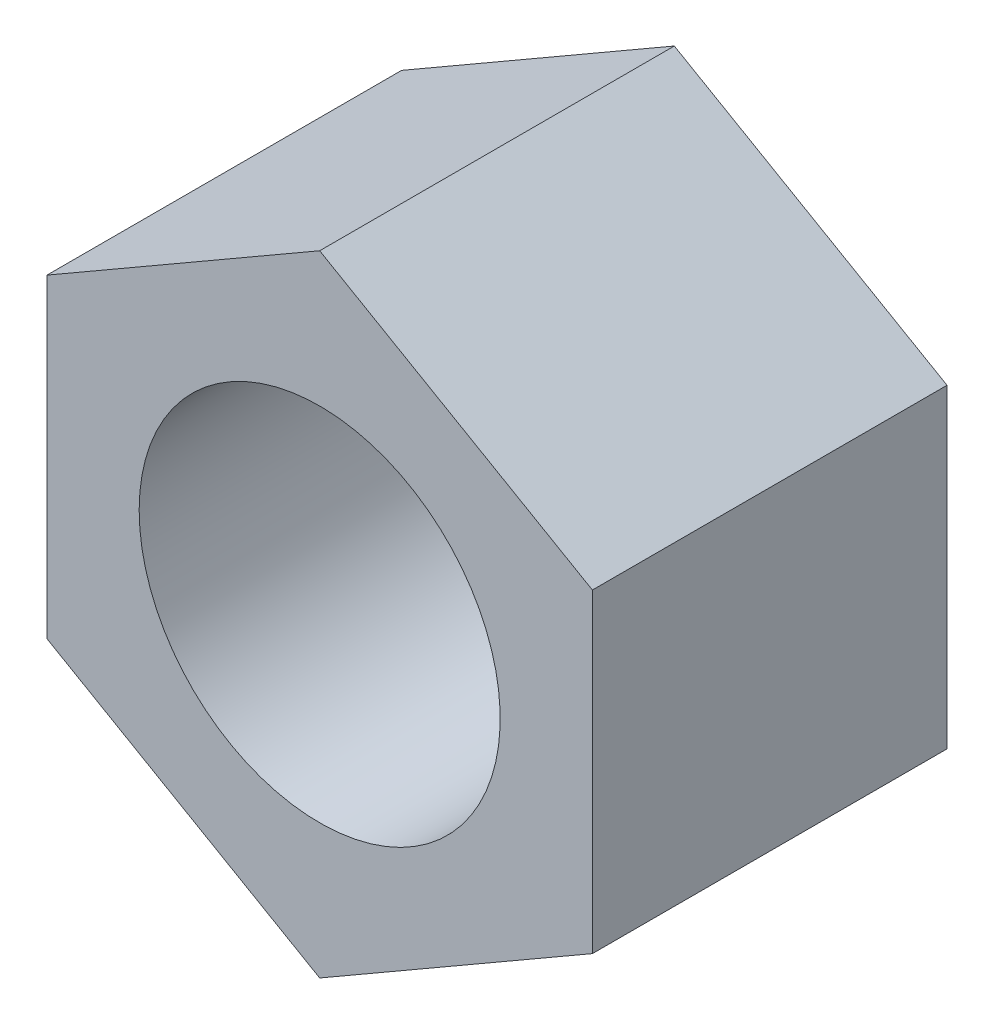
ISO-10303-21;
HEADER;
FILE_DESCRIPTION(('STEP AP214'),'2;1');
FILE_NAME('part.step','',(''),(''),'','','');
FILE_SCHEMA(('AUTOMOTIVE_DESIGN { 1 0 10303 214 1 1 1 1 }'));
ENDSEC;
DATA;
#1=APPLICATION_CONTEXT('core data for automotive mechanical design processes');
#2=APPLICATION_PROTOCOL_DEFINITION('international standard','automotive_design',2000,#1);
#3=PRODUCT_CONTEXT('',#1,'mechanical');
#4=PRODUCT('Part','Part','',(#3));
#5=PRODUCT_RELATED_PRODUCT_CATEGORY('part','',(#4));
#6=PRODUCT_DEFINITION_FORMATION('','',#4);
#7=PRODUCT_DEFINITION_CONTEXT('part definition',#1,'design');
#8=PRODUCT_DEFINITION('design','',#6,#7);
#9=PRODUCT_DEFINITION_SHAPE('','',#8);
#10=(LENGTH_UNIT() NAMED_UNIT(*) SI_UNIT(.MILLI.,.METRE.));
#11=(NAMED_UNIT(*) PLANE_ANGLE_UNIT() SI_UNIT($,.RADIAN.));
#12=(NAMED_UNIT(*) SI_UNIT($,.STERADIAN.) SOLID_ANGLE_UNIT());
#13=UNCERTAINTY_MEASURE_WITH_UNIT(LENGTH_MEASURE(1.E-05),#10,'distance_accuracy_value','');
#14=(GEOMETRIC_REPRESENTATION_CONTEXT(3) GLOBAL_UNCERTAINTY_ASSIGNED_CONTEXT((#13)) GLOBAL_UNIT_ASSIGNED_CONTEXT((#10,
#11,#12)) REPRESENTATION_CONTEXT('',''));
#15=CARTESIAN_POINT('',(0.,0.,0.));
#16=DIRECTION('',(0.,0.,1.));
#17=DIRECTION('',(1.,0.,0.));
#18=AXIS2_PLACEMENT_3D('',#15,#16,#17);
#19=CARTESIAN_POINT('',(0.,0.,87.3252));
#20=DIRECTION('',(0.,0.,1.));
#21=DIRECTION('',(1.,0.,0.));
#22=AXIS2_PLACEMENT_3D('',#19,#20,#21);
#23=PLANE('',#22);
#24=DIRECTION('',(0.,1.,0.));
#25=VECTOR('',#24,1.);
#26=CARTESIAN_POINT('',(67.15125,-38.7697922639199,87.3252));
#27=LINE('',#26,#25);
#28=CARTESIAN_POINT('',(67.15125,-38.7697922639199,87.3252));
#29=VERTEX_POINT('',#28);
#30=CARTESIAN_POINT('',(67.15125,38.7697922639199,87.3252));
#31=VERTEX_POINT('',#30);
#32=EDGE_CURVE('E155',#29,#31,#27,.T.);
#33=ORIENTED_EDGE('',*,*,#32,.T.);
#34=DIRECTION('',(-0.866025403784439,0.5,0.));
#35=VECTOR('',#34,1.);
#36=CARTESIAN_POINT('',(67.15125,38.7697922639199,87.3252));
#37=LINE('',#36,#35);
#38=CARTESIAN_POINT('',(0.,77.5395845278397,87.3252));
#39=VERTEX_POINT('',#38);
#40=EDGE_CURVE('E99',#31,#39,#37,.T.);
#41=ORIENTED_EDGE('',*,*,#40,.T.);
#42=DIRECTION('',(-0.866025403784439,-0.5,0.));
#43=VECTOR('',#42,1.);
#44=CARTESIAN_POINT('',(0.,77.5395845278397,87.3252));
#45=LINE('',#44,#43);
#46=CARTESIAN_POINT('',(-67.1512500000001,38.7697922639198,87.3252));
#47=VERTEX_POINT('',#46);
#48=EDGE_CURVE('E114',#39,#47,#45,.T.);
#49=ORIENTED_EDGE('',*,*,#48,.T.);
#50=DIRECTION('',(0.,-1.,0.));
#51=VECTOR('',#50,1.);
#52=CARTESIAN_POINT('',(-67.1512500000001,38.7697922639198,87.3252));
#53=LINE('',#52,#51);
#54=CARTESIAN_POINT('',(-67.1512500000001,-38.7697922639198,87.3252));
#55=VERTEX_POINT('',#54);
#56=EDGE_CURVE('E110',#47,#55,#53,.T.);
#57=ORIENTED_EDGE('',*,*,#56,.T.);
#58=DIRECTION('',(0.866025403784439,-0.5,0.));
#59=VECTOR('',#58,1.);
#60=CARTESIAN_POINT('',(-67.1512500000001,-38.7697922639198,87.3252));
#61=LINE('',#60,#59);
#62=CARTESIAN_POINT('',(0.,-77.5395845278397,87.3252));
#63=VERTEX_POINT('',#62);
#64=EDGE_CURVE('E112',#55,#63,#61,.T.);
#65=ORIENTED_EDGE('',*,*,#64,.T.);
#66=DIRECTION('',(0.866025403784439,0.5,0.));
#67=VECTOR('',#66,1.);
#68=CARTESIAN_POINT('',(0.,-77.5395845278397,87.3252));
#69=LINE('',#68,#67);
#70=EDGE_CURVE('E64',#63,#29,#69,.T.);
#71=ORIENTED_EDGE('',*,*,#70,.T.);
#72=EDGE_LOOP('',(#33,#41,#49,#57,#65,#71));
#73=FACE_BOUND('',#72,.T.);
#74=CARTESIAN_POINT('',(0.,0.,87.3252));
#75=DIRECTION('',(0.,0.,1.));
#76=DIRECTION('',(1.,0.,0.));
#77=AXIS2_PLACEMENT_3D('',#74,#75,#76);
#78=CIRCLE('',#77,44.45);
#79=CARTESIAN_POINT('',(-44.45,0.,87.3252));
#80=VERTEX_POINT('',#79);
#81=EDGE_CURVE('E136',#80,#80,#78,.T.);
#82=ORIENTED_EDGE('',*,*,#81,.F.);
#83=EDGE_LOOP('',(#82));
#84=FACE_BOUND('',#83,.T.);
#85=ADVANCED_FACE('F44',(#73,#84),#23,.T.);
#86=CARTESIAN_POINT('',(0.,0.,0.));
#87=DIRECTION('',(0.,0.,1.));
#88=DIRECTION('',(1.,0.,0.));
#89=AXIS2_PLACEMENT_3D('',#86,#87,#88);
#90=PLANE('',#89);
#91=DIRECTION('',(0.,1.,0.));
#92=VECTOR('',#91,1.);
#93=CARTESIAN_POINT('',(67.15125,-38.7697922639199,0.));
#94=LINE('',#93,#92);
#95=CARTESIAN_POINT('',(67.15125,-38.7697922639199,0.));
#96=VERTEX_POINT('',#95);
#97=CARTESIAN_POINT('',(67.15125,38.7697922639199,0.));
#98=VERTEX_POINT('',#97);
#99=EDGE_CURVE('E133',#96,#98,#94,.T.);
#100=ORIENTED_EDGE('',*,*,#99,.F.);
#101=DIRECTION('',(0.866025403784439,0.5,0.));
#102=VECTOR('',#101,1.);
#103=CARTESIAN_POINT('',(0.,-77.5395845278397,0.));
#104=LINE('',#103,#102);
#105=CARTESIAN_POINT('',(0.,-77.5395845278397,0.));
#106=VERTEX_POINT('',#105);
#107=EDGE_CURVE('E95',#106,#96,#104,.T.);
#108=ORIENTED_EDGE('',*,*,#107,.F.);
#109=DIRECTION('',(0.866025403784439,-0.5,0.));
#110=VECTOR('',#109,1.);
#111=CARTESIAN_POINT('',(-67.1512500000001,-38.7697922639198,0.));
#112=LINE('',#111,#110);
#113=CARTESIAN_POINT('',(-67.1512500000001,-38.7697922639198,0.));
#114=VERTEX_POINT('',#113);
#115=EDGE_CURVE('E88',#114,#106,#112,.T.);
#116=ORIENTED_EDGE('',*,*,#115,.F.);
#117=DIRECTION('',(0.,-1.,0.));
#118=VECTOR('',#117,1.);
#119=CARTESIAN_POINT('',(-67.1512500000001,38.7697922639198,0.));
#120=LINE('',#119,#118);
#121=CARTESIAN_POINT('',(-67.1512500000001,38.7697922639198,0.));
#122=VERTEX_POINT('',#121);
#123=EDGE_CURVE('E125',#122,#114,#120,.T.);
#124=ORIENTED_EDGE('',*,*,#123,.F.);
#125=DIRECTION('',(-0.866025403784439,-0.5,0.));
#126=VECTOR('',#125,1.);
#127=CARTESIAN_POINT('',(0.,77.5395845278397,0.));
#128=LINE('',#127,#126);
#129=CARTESIAN_POINT('',(0.,77.5395845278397,0.));
#130=VERTEX_POINT('',#129);
#131=EDGE_CURVE('E141',#130,#122,#128,.T.);
#132=ORIENTED_EDGE('',*,*,#131,.F.);
#133=DIRECTION('',(-0.866025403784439,0.5,0.));
#134=VECTOR('',#133,1.);
#135=CARTESIAN_POINT('',(67.15125,38.7697922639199,0.));
#136=LINE('',#135,#134);
#137=EDGE_CURVE('E139',#98,#130,#136,.T.);
#138=ORIENTED_EDGE('',*,*,#137,.F.);
#139=EDGE_LOOP('',(#100,#108,#116,#124,#132,#138));
#140=FACE_BOUND('',#139,.T.);
#141=CARTESIAN_POINT('',(0.,0.,0.));
#142=DIRECTION('',(0.,0.,1.));
#143=DIRECTION('',(1.,0.,0.));
#144=AXIS2_PLACEMENT_3D('',#141,#142,#143);
#145=CIRCLE('',#144,44.45);
#146=CARTESIAN_POINT('',(-44.45,0.,0.));
#147=VERTEX_POINT('',#146);
#148=EDGE_CURVE('E249',#147,#147,#145,.T.);
#149=ORIENTED_EDGE('',*,*,#148,.T.);
#150=EDGE_LOOP('',(#149));
#151=FACE_BOUND('',#150,.T.);
#152=ADVANCED_FACE('F164',(#140,#151),#90,.F.);
#153=CARTESIAN_POINT('',(67.15125,-38.7697922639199,87.3252));
#154=DIRECTION('',(-1.,0.,0.));
#155=DIRECTION('',(0.,-1.,0.));
#156=AXIS2_PLACEMENT_3D('',#153,#154,#155);
#157=PLANE('',#156);
#158=ORIENTED_EDGE('',*,*,#99,.T.);
#159=DIRECTION('',(0.,0.,-1.));
#160=VECTOR('',#159,1.);
#161=CARTESIAN_POINT('',(67.15125,38.7697922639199,87.3252));
#162=LINE('',#161,#160);
#163=EDGE_CURVE('E11',#31,#98,#162,.T.);
#164=ORIENTED_EDGE('',*,*,#163,.F.);
#165=ORIENTED_EDGE('',*,*,#32,.F.);
#166=DIRECTION('',(0.,0.,-1.));
#167=VECTOR('',#166,1.);
#168=CARTESIAN_POINT('',(67.15125,-38.7697922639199,87.3252));
#169=LINE('',#168,#167);
#170=EDGE_CURVE('E132',#29,#96,#169,.T.);
#171=ORIENTED_EDGE('',*,*,#170,.T.);
#172=EDGE_LOOP('',(#158,#164,#165,#171));
#173=FACE_BOUND('',#172,.T.);
#174=ADVANCED_FACE('F50',(#173),#157,.F.);
#175=CARTESIAN_POINT('',(67.15125,38.7697922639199,87.3252));
#176=DIRECTION('',(-0.5,-0.866025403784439,0.));
#177=DIRECTION('',(0.866025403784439,-0.5,0.));
#178=AXIS2_PLACEMENT_3D('',#175,#176,#177);
#179=PLANE('',#178);
#180=ORIENTED_EDGE('',*,*,#137,.T.);
#181=DIRECTION('',(0.,0.,-1.));
#182=VECTOR('',#181,1.);
#183=CARTESIAN_POINT('',(0.,77.5395845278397,87.3252));
#184=LINE('',#183,#182);
#185=EDGE_CURVE('E54',#39,#130,#184,.T.);
#186=ORIENTED_EDGE('',*,*,#185,.F.);
#187=ORIENTED_EDGE('',*,*,#40,.F.);
#188=ORIENTED_EDGE('',*,*,#163,.T.);
#189=EDGE_LOOP('',(#180,#186,#187,#188));
#190=FACE_BOUND('',#189,.T.);
#191=ADVANCED_FACE('F188',(#190),#179,.F.);
#192=CARTESIAN_POINT('',(0.,77.5395845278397,87.3252));
#193=DIRECTION('',(0.5,-0.866025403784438,0.));
#194=DIRECTION('',(0.866025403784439,0.5,0.));
#195=AXIS2_PLACEMENT_3D('',#192,#193,#194);
#196=PLANE('',#195);
#197=ORIENTED_EDGE('',*,*,#131,.T.);
#198=DIRECTION('',(0.,0.,-1.));
#199=VECTOR('',#198,1.);
#200=CARTESIAN_POINT('',(-67.1512500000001,38.7697922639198,87.3252));
#201=LINE('',#200,#199);
#202=EDGE_CURVE('E124',#47,#122,#201,.T.);
#203=ORIENTED_EDGE('',*,*,#202,.F.);
#204=ORIENTED_EDGE('',*,*,#48,.F.);
#205=ORIENTED_EDGE('',*,*,#185,.T.);
#206=EDGE_LOOP('',(#197,#203,#204,#205));
#207=FACE_BOUND('',#206,.T.);
#208=ADVANCED_FACE('F165',(#207),#196,.F.);
#209=CARTESIAN_POINT('',(-67.1512500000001,38.7697922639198,87.3252));
#210=DIRECTION('',(1.,0.,0.));
#211=DIRECTION('',(0.,1.,0.));
#212=AXIS2_PLACEMENT_3D('',#209,#210,#211);
#213=PLANE('',#212);
#214=ORIENTED_EDGE('',*,*,#123,.T.);
#215=DIRECTION('',(0.,0.,-1.));
#216=VECTOR('',#215,1.);
#217=CARTESIAN_POINT('',(-67.1512500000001,-38.7697922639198,87.3252));
#218=LINE('',#217,#216);
#219=EDGE_CURVE('E116',#55,#114,#218,.T.);
#220=ORIENTED_EDGE('',*,*,#219,.F.);
#221=ORIENTED_EDGE('',*,*,#56,.F.);
#222=ORIENTED_EDGE('',*,*,#202,.T.);
#223=EDGE_LOOP('',(#214,#220,#221,#222));
#224=FACE_BOUND('',#223,.T.);
#225=ADVANCED_FACE('F118',(#224),#213,.F.);
#226=CARTESIAN_POINT('',(-67.1512500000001,-38.7697922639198,87.3252));
#227=DIRECTION('',(0.5,0.866025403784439,0.));
#228=DIRECTION('',(-0.866025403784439,0.5,0.));
#229=AXIS2_PLACEMENT_3D('',#226,#227,#228);
#230=PLANE('',#229);
#231=ORIENTED_EDGE('',*,*,#115,.T.);
#232=DIRECTION('',(0.,0.,-1.));
#233=VECTOR('',#232,1.);
#234=CARTESIAN_POINT('',(0.,-77.5395845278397,87.3252));
#235=LINE('',#234,#233);
#236=EDGE_CURVE('E121',#63,#106,#235,.T.);
#237=ORIENTED_EDGE('',*,*,#236,.F.);
#238=ORIENTED_EDGE('',*,*,#64,.F.);
#239=ORIENTED_EDGE('',*,*,#219,.T.);
#240=EDGE_LOOP('',(#231,#237,#238,#239));
#241=FACE_BOUND('',#240,.T.);
#242=ADVANCED_FACE('F130',(#241),#230,.F.);
#243=CARTESIAN_POINT('',(0.,-77.5395845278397,87.3252));
#244=DIRECTION('',(-0.5,0.866025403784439,0.));
#245=DIRECTION('',(-0.866025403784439,-0.5,0.));
#246=AXIS2_PLACEMENT_3D('',#243,#244,#245);
#247=PLANE('',#246);
#248=ORIENTED_EDGE('',*,*,#107,.T.);
#249=ORIENTED_EDGE('',*,*,#170,.F.);
#250=ORIENTED_EDGE('',*,*,#70,.F.);
#251=ORIENTED_EDGE('',*,*,#236,.T.);
#252=EDGE_LOOP('',(#248,#249,#250,#251));
#253=FACE_BOUND('',#252,.T.);
#254=ADVANCED_FACE('F168',(#253),#247,.F.);
#255=CARTESIAN_POINT('',(0.,0.,87.3252));
#256=DIRECTION('',(0.,0.,-1.));
#257=DIRECTION('',(-1.,0.,0.));
#258=AXIS2_PLACEMENT_3D('',#255,#256,#257);
#259=CYLINDRICAL_SURFACE('',#258,44.45);
#260=CARTESIAN_POINT('',(-44.45,0.,87.3252));
#261=CARTESIAN_POINT('',(-44.45,0.,86.4155625));
#262=CARTESIAN_POINT('',(-44.45,0.,85.505925));
#263=CARTESIAN_POINT('',(-44.45,0.,83.68665));
#264=CARTESIAN_POINT('',(-44.45,0.,82.7770125));
#265=CARTESIAN_POINT('',(-44.45,0.,80.9577375));
#266=CARTESIAN_POINT('',(-44.45,0.,80.0481));
#267=CARTESIAN_POINT('',(-44.45,0.,78.228825));
#268=CARTESIAN_POINT('',(-44.45,0.,77.3191875));
#269=CARTESIAN_POINT('',(-44.45,0.,75.4999125));
#270=CARTESIAN_POINT('',(-44.45,0.,74.590275));
#271=CARTESIAN_POINT('',(-44.45,0.,72.771));
#272=CARTESIAN_POINT('',(-44.45,0.,71.8613625));
#273=CARTESIAN_POINT('',(-44.45,0.,70.0420875));
#274=CARTESIAN_POINT('',(-44.45,0.,69.13245));
#275=CARTESIAN_POINT('',(-44.45,0.,67.313175));
#276=CARTESIAN_POINT('',(-44.45,0.,66.4035375));
#277=CARTESIAN_POINT('',(-44.45,0.,64.5842625));
#278=CARTESIAN_POINT('',(-44.45,0.,63.674625));
#279=CARTESIAN_POINT('',(-44.45,0.,61.85535));
#280=CARTESIAN_POINT('',(-44.45,0.,60.9457125));
#281=CARTESIAN_POINT('',(-44.45,0.,59.1264375));
#282=CARTESIAN_POINT('',(-44.45,0.,58.2168));
#283=CARTESIAN_POINT('',(-44.45,0.,56.397525));
#284=CARTESIAN_POINT('',(-44.45,0.,55.4878875));
#285=CARTESIAN_POINT('',(-44.45,0.,53.6686125));
#286=CARTESIAN_POINT('',(-44.45,0.,52.758975));
#287=CARTESIAN_POINT('',(-44.45,0.,50.9397));
#288=CARTESIAN_POINT('',(-44.45,0.,50.0300625));
#289=CARTESIAN_POINT('',(-44.45,0.,48.2107875));
#290=CARTESIAN_POINT('',(-44.45,0.,47.30115));
#291=CARTESIAN_POINT('',(-44.45,0.,45.481875));
#292=CARTESIAN_POINT('',(-44.45,0.,44.5722375));
#293=CARTESIAN_POINT('',(-44.45,0.,42.7529625));
#294=CARTESIAN_POINT('',(-44.45,0.,41.843325));
#295=CARTESIAN_POINT('',(-44.45,0.,40.02405));
#296=CARTESIAN_POINT('',(-44.45,0.,39.1144125));
#297=CARTESIAN_POINT('',(-44.45,0.,37.2951375));
#298=CARTESIAN_POINT('',(-44.45,0.,36.3855));
#299=CARTESIAN_POINT('',(-44.45,0.,34.566225));
#300=CARTESIAN_POINT('',(-44.45,0.,33.6565875));
#301=CARTESIAN_POINT('',(-44.45,0.,31.8373125));
#302=CARTESIAN_POINT('',(-44.45,0.,30.927675));
#303=CARTESIAN_POINT('',(-44.45,0.,29.1084));
#304=CARTESIAN_POINT('',(-44.45,0.,28.1987625));
#305=CARTESIAN_POINT('',(-44.45,0.,26.3794875));
#306=CARTESIAN_POINT('',(-44.45,0.,25.46985));
#307=CARTESIAN_POINT('',(-44.45,0.,23.650575));
#308=CARTESIAN_POINT('',(-44.45,0.,22.7409375));
#309=CARTESIAN_POINT('',(-44.45,0.,20.9216625));
#310=CARTESIAN_POINT('',(-44.45,0.,20.012025));
#311=CARTESIAN_POINT('',(-44.45,0.,18.19275));
#312=CARTESIAN_POINT('',(-44.45,0.,17.2831125));
#313=CARTESIAN_POINT('',(-44.45,0.,15.4638375));
#314=CARTESIAN_POINT('',(-44.45,0.,14.5542));
#315=CARTESIAN_POINT('',(-44.45,0.,12.734925));
#316=CARTESIAN_POINT('',(-44.45,0.,11.8252875));
#317=CARTESIAN_POINT('',(-44.45,0.,10.0060125));
#318=CARTESIAN_POINT('',(-44.45,0.,9.096375));
#319=CARTESIAN_POINT('',(-44.45,0.,7.2771));
#320=CARTESIAN_POINT('',(-44.45,0.,6.3674625));
#321=CARTESIAN_POINT('',(-44.45,0.,4.5481875));
#322=CARTESIAN_POINT('',(-44.45,0.,3.63855));
#323=CARTESIAN_POINT('',(-44.45,0.,1.819275));
#324=CARTESIAN_POINT('',(-44.45,0.,0.9096375));
#325=CARTESIAN_POINT('',(-44.45,0.,0.));
#326=B_SPLINE_CURVE_WITH_KNOTS('',3,(#260,#261,#262,#263,#264,#265,#266,#267,#268,#269,#270,
#271,#272,#273,#274,#275,#276,#277,#278,#279,#280,#281,#282,#283,#284,#285,#286,#287,#288,#289,
#290,#291,#292,#293,#294,#295,#296,#297,#298,#299,#300,#301,#302,#303,#304,#305,#306,#307,#308,
#309,#310,#311,#312,#313,#314,#315,#316,#317,#318,#319,#320,#321,#322,#323,#324,#325),
.UNSPECIFIED.,.F.,.F.,(4,2,2,2,2,2,2,2,2,2,2,2,2,2,2,2,2,2,2,2,2,2,2,2,2,2,2,2,2,2,2,2,4),(0.,
2.72891249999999,5.457825,8.18673749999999,10.91565,13.6445625,16.373475,19.1023875,21.8313,
24.5602125,27.289125,30.0180375,32.74695,35.4758625,38.204775,40.9336875,43.6626,46.3915125,
49.120425,51.8493375,54.57825,57.3071625,60.036075,62.7649875,65.4939,68.2228125,70.951725,
73.6806375,76.40955,79.1384625,81.867375,84.5962875,87.3252),.UNSPECIFIED.);
#327=EDGE_CURVE('BSEAM175',#80,#147,#326,.T.);
#328=ORIENTED_EDGE('',*,*,#81,.T.);
#329=ORIENTED_EDGE('',*,*,#148,.F.);
#330=ORIENTED_EDGE('',*,*,#327,.T.);
#331=ORIENTED_EDGE('',*,*,#327,.F.);
#332=EDGE_LOOP('',(#328,#330,#329,#331));
#333=FACE_BOUND('',#332,.T.);
#334=ADVANCED_FACE('F175',(#333),#259,.F.);
#335=CLOSED_SHELL('',(#85,#152,#174,#191,#208,#225,#242,#254,#334));
#336=MANIFOLD_SOLID_BREP('B2',#335);
#337=ADVANCED_BREP_SHAPE_REPRESENTATION('',(#18,#336),#14);
#338=SHAPE_DEFINITION_REPRESENTATION(#9,#337);
ENDSEC;
END-ISO-10303-21;
